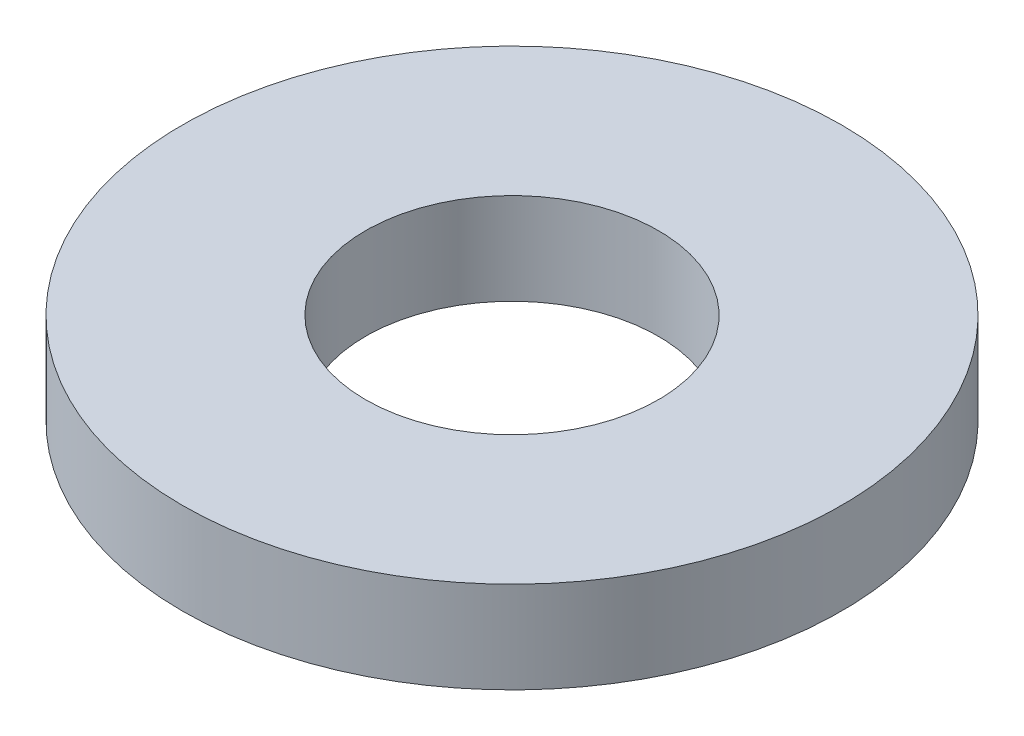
from build123d import *

# Parameters (mm, degrees)
SKETCH1_R           = 18
SKETCH1_R_2         = 8
BOSS_EXTRUDE1_DEPTH = 5


with BuildPart() as part:
    # Sketch1 → Boss-Extrude1 (new body)
    with BuildSketch(Plane(origin=(0, 0, 0), x_dir=(1, 0, 0), z_dir=(0, 1, 0))):
        with Locations(Location((0, 0, 0), (0, 0, 270))):
            Circle(SKETCH1_R)
        with Locations(Location((0, 0, 0), (0, 0, 270))):
            Circle(SKETCH1_R_2, mode=Mode.SUBTRACT)
    extrude(amount=BOSS_EXTRUDE1_DEPTH)


solid = part.part
